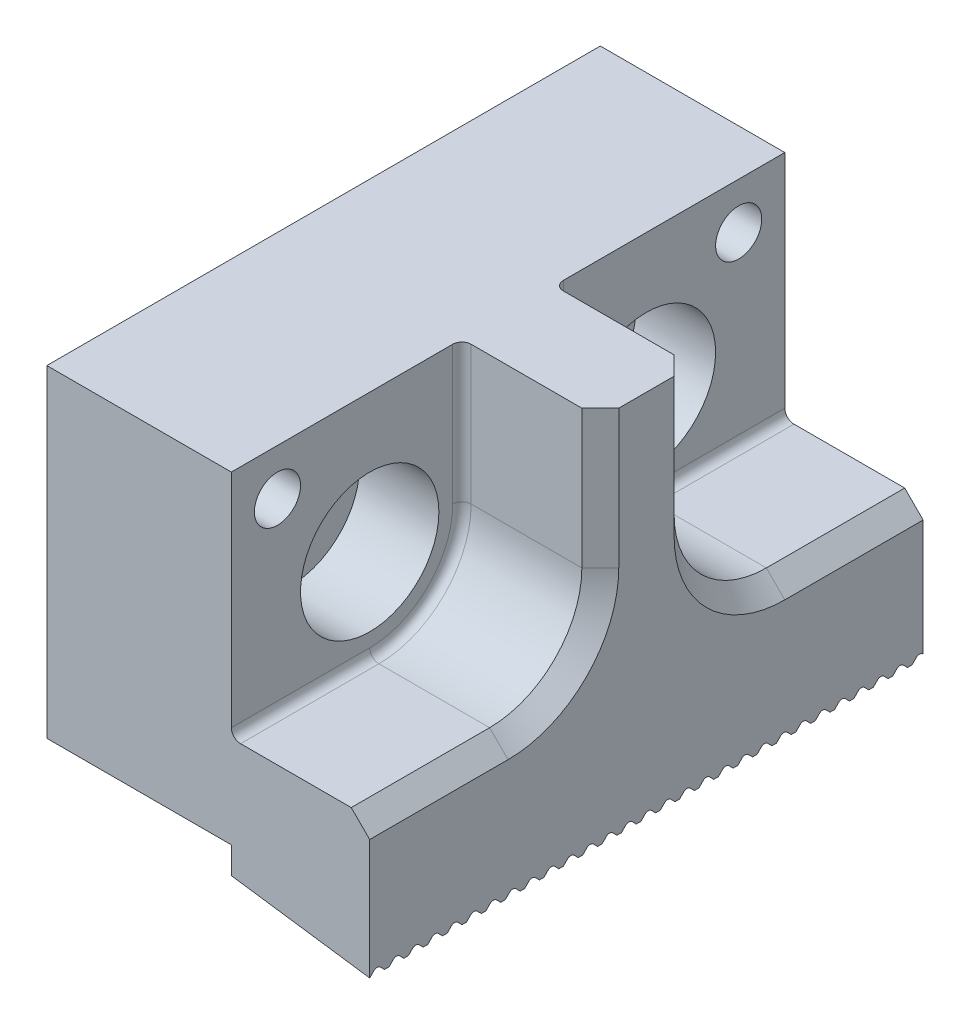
from build123d import *

# Parameters (mm, degrees)
EXTRUDE_1_DEPTH              = 60
CUT_EXTRUDE_1_DEPTH          = 15
HOLE_WIZARD_M8_1_D           = 9
HOLE_WIZARD_M8_1_CBORE_D     = 15
HOLE_WIZARD_M8_1_CBORE_DEPTH = 8.6
HOLE_WIZARD_M6_1_D           = 5
CUT_EXTRUDE_2_DEPTH          = 15.147413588
PATTERN_LINEAR_1_COUNT       = 29
PATTERN_LINEAR_1_PITCH       = 2.1
CHAMFER_1_SIZE               = 2
FILLET_1_R                   = 1


with BuildPart() as part:
    # Sketch 1 → Extrude 1 (new body)
    with BuildSketch(Plane.XY):
        Polygon((-10.435444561, -13.252496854), (-10.435444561, 21.747503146), (24.564555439, 21.747503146), (24.564555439, -18.252496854), (9.564555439, -16.144384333), (9.564555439, -13.252496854), align=None)
    extrude(amount=EXTRUDE_1_DEPTH)

    # Sketch 2 → Cut-Extrude 1 (cut)
    with BuildSketch(Plane(origin=(24.564555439, 0, 0), x_dir=(0, 0, -1), z_dir=(1, 0, 0))):
        with BuildLine():
            Line((-60, 21.747503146), (-35, 21.747503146))
            Line((-35, 21.747503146), (-35, 6.747503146))
            ThreePointArc((-35, 6.747503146), (-37.928932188, -0.323564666), (-45, -3.252496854))
            Line((-45, -3.252496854), (-60, -3.252496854))
            Line((-60, -3.252496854), (-60, 21.747503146))
        make_face()
        with BuildLine():
            Line((0, 21.747503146), (-25, 21.747503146))
            Line((-25, 21.747503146), (-25, 6.747503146))
            ThreePointArc((-25, 6.747503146), (-22.071067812, -0.323564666), (-15, -3.252496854))
            Line((-15, -3.252496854), (0, -3.252496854))
            Line((0, -3.252496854), (0, 21.747503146))
        make_face()
    extrude(amount=-CUT_EXTRUDE_1_DEPTH, mode=Mode.SUBTRACT)

    # Hole Wizard M8 _1 (through all)
    with Locations(Plane(origin=(9.564555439, 6.747503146, 15), x_dir=(0, 1, 0), z_dir=(1, 0, 0))):
        with Locations((0, 0), (0, 30)):
            CounterBoreHole(HOLE_WIZARD_M8_1_D / 2, HOLE_WIZARD_M8_1_CBORE_D / 2, HOLE_WIZARD_M8_1_CBORE_DEPTH)

    # Hole Wizard M6 _1 (through all)
    with Locations(Plane(origin=(9.564555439, 16.747503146, 5), x_dir=(0, 1, 0), z_dir=(1, 0, 0))):
        with Locations((0, 0), (0, 50)):
            Hole(HOLE_WIZARD_M6_1_D / 2)

    # Sketch 7 → Cut-Extrude 2 (cut, along a direction that is not the sketch's normal)
    with BuildSketch(Plane(origin=(24.564555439, 0, 0), x_dir=(0, 0, -1), z_dir=(1, 0, 0))):
        with BuildLine():
            Line((-60, -18.252496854), (-58.4, -18.252496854))
            Line((-58.4, -18.252496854), (-58.846446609, -17.801662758))
            add(Edge.make_bspline(
                [(-58.846446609, -17.801662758), (-59.2, -17.444634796), (-59.553553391, -17.801662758)],
                knots=[2.35619449, 2.35619449, 2.35619449, 3.926990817, 3.926990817, 3.926990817], degree=2, weights=[1, 0.707106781, 1]))
            Line((-59.553553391, -17.801662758), (-60, -18.252496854))
        make_face()
    cut_extrude_2 = extrude(amount=-CUT_EXTRUDE_2_DEPTH, dir=(0.9902680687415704, -0.13917310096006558, 0), mode=Mode.SUBTRACT)

    # Pattern Linear 1: Cut-Extrude 2 ×29
    with Locations(*[(0, 0, -i * PATTERN_LINEAR_1_PITCH) for i in range(1, PATTERN_LINEAR_1_COUNT)]):
        add(cut_extrude_2, mode=Mode.SUBTRACT)

    # Chamfer 1
    chamfer_1_edges = [part.edges().sort_by_distance(p)[0] for p in [
        (24.564555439, -3.252496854, 52.5),
        (24.564555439, -0.323564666, 37.928932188),
        (24.564555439, 14.247503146, 35),
        (24.564555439, 14.247503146, 25),
        (24.564555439, -0.323564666, 22.071067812),
        (24.564555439, -3.252496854, 7.5),
    ]]
    chamfer(chamfer_1_edges, length=CHAMFER_1_SIZE)

    # Fillet 1
    fillet_1_edges = [part.edges().sort_by_distance(p)[0] for p in [
        (9.564555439, 14.247503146, 35),
        (9.564555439, -0.323564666, 37.928932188),
        (9.564555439, -3.252496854, 52.5),
        (9.564555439, -3.252496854, 7.5),
        (9.564555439, -0.323564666, 22.071067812),
        (9.564555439, 14.247503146, 25),
    ]]
    fillet(fillet_1_edges, radius=FILLET_1_R)


solid = part.part
